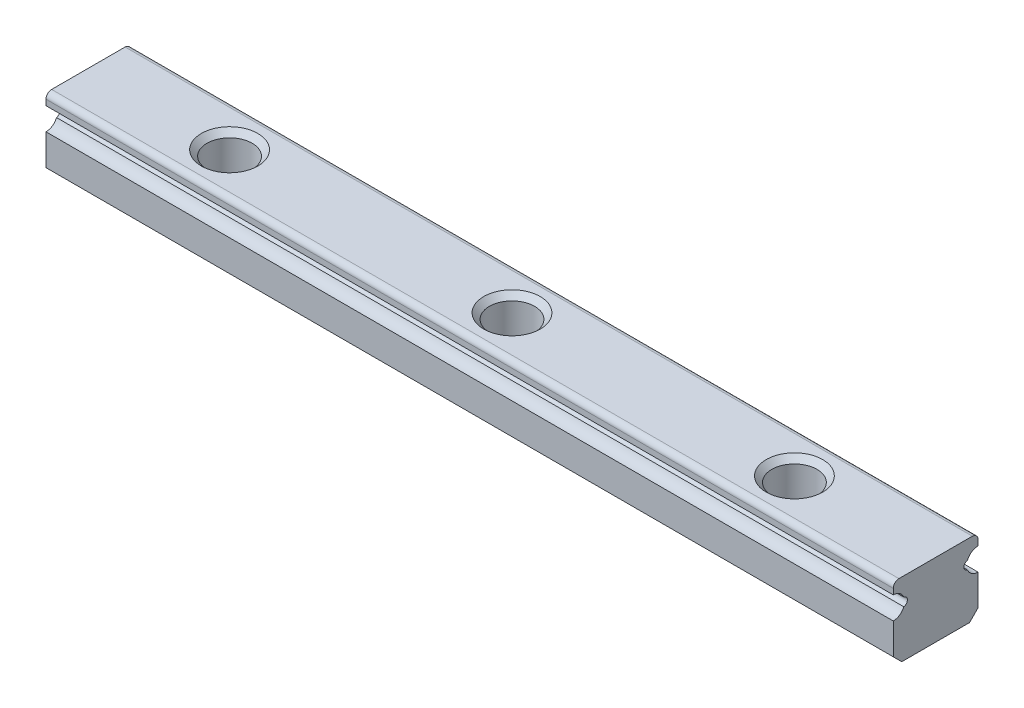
from build123d import *

# Parameters (mm, degrees)
EXTRUDE1_DEPTH     = 30
LPATTERN1_COUNT    = 3
LPATTERN1_PITCH    = 10
CUT_EXTRUDE1_DEPTH = 31.149792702
FILLET1_R          = 0.2


with BuildPart() as part:
    # Sketch 1 → Extrude1 (new body)
    with BuildSketch(Plane(origin=(0, 0, 0), x_dir=(0, 0, -1), z_dir=(1, 0, 0))):
        Polygon((-1.2, 0), (-1.5, 0.3), (-1.5, 2.6), (1.5, 2.6), (1.5, 0.3), (1.2, 0), align=None)
    extrude(amount=-EXTRUDE1_DEPTH)

    # Sketch 2 → HoleWzd1 (revolve, cut)
    with BuildSketch(Plane(origin=(-5, 2.6, 0), x_dir=(0, 0, 1), z_dir=(1, 0, 0))):
        Polygon((0, 0), (0, 2.6), (1, 2.6), (0.8, 2.4), (0.8, 0.2), (1, 0), align=None)
    holewzd1 = revolve(axis=Axis((-5, 8.95, 0), (0, -1, 0)), mode=Mode.SUBTRACT)

    # LPattern1: HoleWzd1 ×3
    with Locations(*[(-i * LPATTERN1_PITCH, 0, 0) for i in range(1, LPATTERN1_COUNT)]):
        add(holewzd1, mode=Mode.SUBTRACT)

    # Sketch2 → Cut-Extrude1 (cut, through all)
    with BuildSketch(Plane(origin=(0, 0, 0), x_dir=(0, 0, -1), z_dir=(1, 0, 0))):
        with BuildLine():
            ThreePointArc((1.128571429, 1.651538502), (1.9, 1.8), (1.128571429, 1.948461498))
            ThreePointArc((1.128571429, 1.948461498), (1, 1.8), (1.128571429, 1.651538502))
        make_face()
        with BuildLine():
            ThreePointArc((-1.128571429, 1.948461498), (-1, 1.8), (-1.128571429, 1.651538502))
            ThreePointArc((-1.128571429, 1.651538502), (-1.9, 1.8), (-1.128571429, 1.948461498))
        make_face()
    extrude(amount=-CUT_EXTRUDE1_DEPTH, mode=Mode.SUBTRACT)

    # Fillet1
    fillet1_edges = [part.edges().sort_by_distance(p)[0] for p in [
        (-15, 2.6, 1.5),
        (-15, 2.6, -1.5),
    ]]
    fillet(fillet1_edges, radius=FILLET1_R)


solid = part.part
